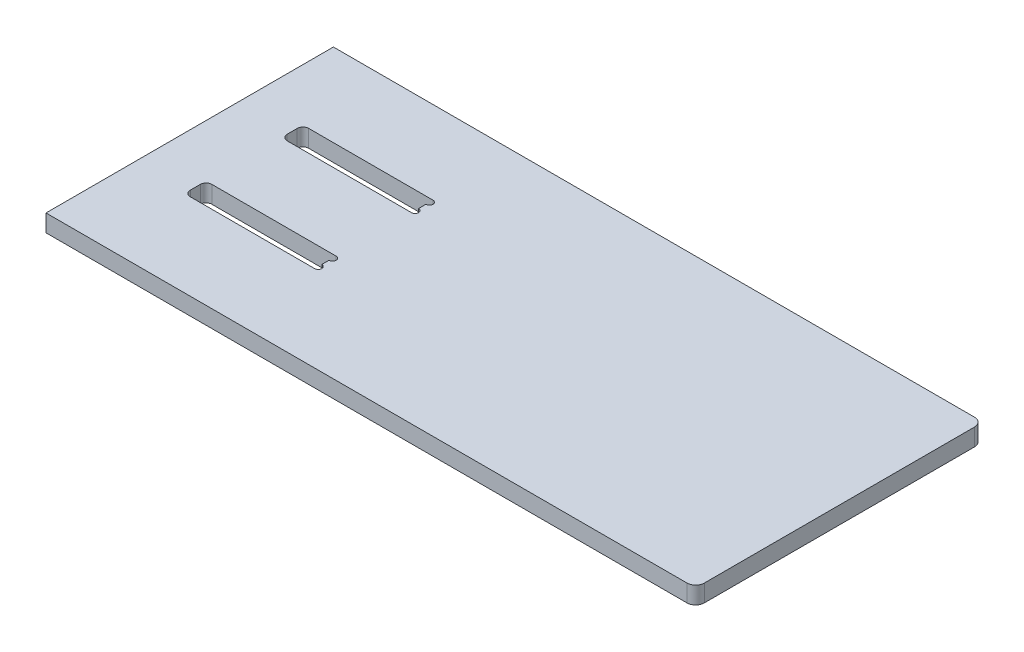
from build123d import *

# Parameters (mm, degrees)
BOSS_EXTRUDE1_DEPTH = 12


with BuildPart() as part:
    # Sketch2 → Boss-Extrude1 (new body)
    with BuildSketch(Plane(origin=(0, 0, 0), x_dir=(1, 0, 0), z_dir=(0, 1, 0))):
        with BuildLine():
            Line((220.05, 100), (-226.05, 100))
            Line((-226.05, 100), (-226.05, -100))
            Line((-226.05, -100), (220.05, -100))
            ThreePointArc((220.05, -100), (224.292640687, -98.242640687), (226.05, -94))
            Line((226.05, -94), (226.05, 94))
            ThreePointArc((226.05, 94), (224.292640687, 98.242640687), (220.05, 100))
        make_face()
        with BuildLine():
            Line((-99.07, -35.073333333), (-99.07, -30.073333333))
            ThreePointArc((-99.07, -30.073333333), (-96.57, -27.573333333), (-99.07, -25.073333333))
            Line((-99.07, -25.073333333), (-185.57, -25.073333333))
            ThreePointArc((-185.57, -25.073333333), (-188.398427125, -26.244906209), (-189.57, -29.073333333))
            Line((-189.57, -29.073333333), (-189.57, -36.073333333))
            ThreePointArc((-189.57, -36.073333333), (-188.398427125, -38.901760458), (-185.57, -40.073333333))
            Line((-185.57, -40.073333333), (-99.07, -40.073333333))
            ThreePointArc((-99.07, -40.073333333), (-96.57, -37.573333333), (-99.07, -35.073333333))
        make_face(mode=Mode.SUBTRACT)
        with BuildLine():
            Line((-185.57, 27.356666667), (-99.07, 27.356666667))
            ThreePointArc((-99.07, 27.356666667), (-96.57, 29.856666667), (-99.07, 32.356666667))
            Line((-99.07, 32.356666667), (-99.07, 37.356666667))
            ThreePointArc((-99.07, 37.356666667), (-96.57, 39.856666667), (-99.07, 42.356666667))
            Line((-99.07, 42.356666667), (-185.57, 42.356666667))
            ThreePointArc((-185.57, 42.356666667), (-188.398427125, 41.185093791), (-189.57, 38.356666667))
            Line((-189.57, 38.356666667), (-189.57, 31.356666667))
            ThreePointArc((-189.57, 31.356666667), (-188.398427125, 28.528239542), (-185.57, 27.356666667))
        make_face(mode=Mode.SUBTRACT)
    extrude(amount=BOSS_EXTRUDE1_DEPTH)


solid = part.part
